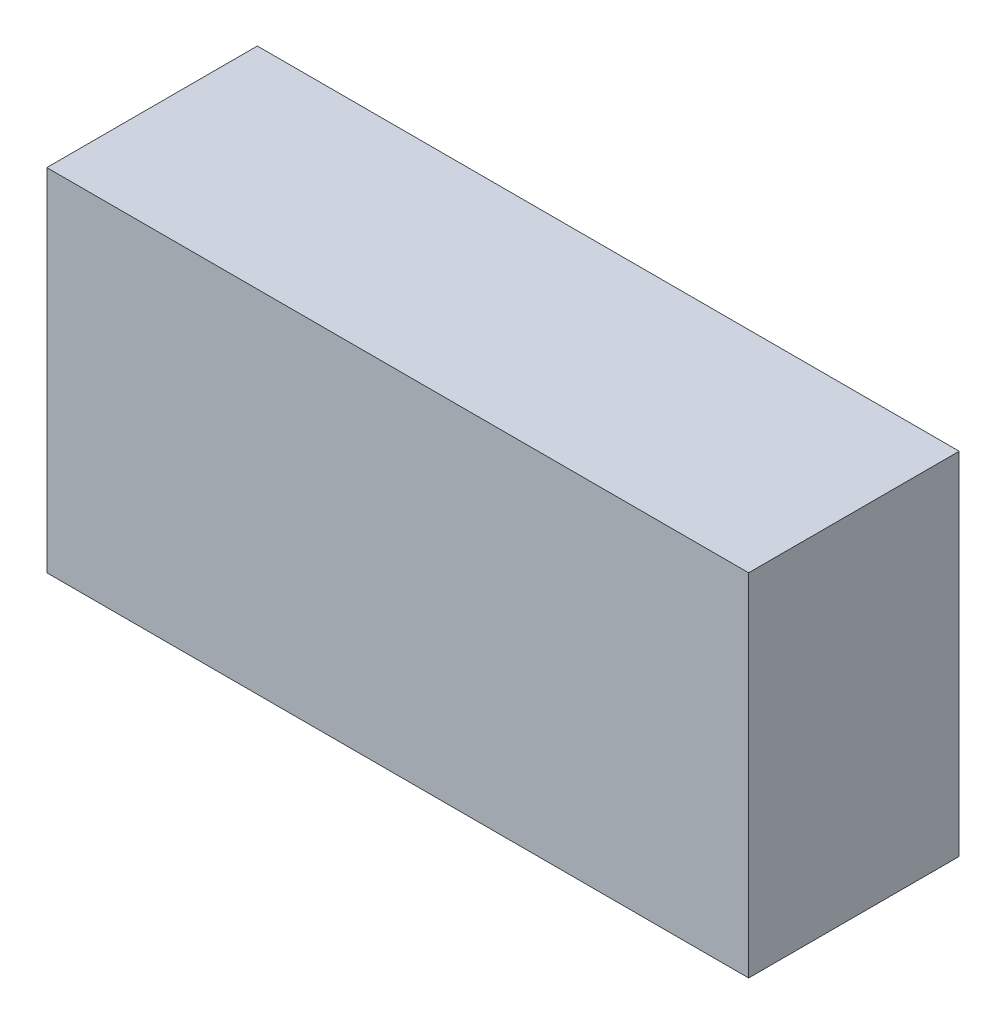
ISO-10303-21;
HEADER;
FILE_DESCRIPTION(('STEP AP214'),'2;1');
FILE_NAME('part.step','',(''),(''),'','','');
FILE_SCHEMA(('AUTOMOTIVE_DESIGN { 1 0 10303 214 1 1 1 1 }'));
ENDSEC;
DATA;
#1=APPLICATION_CONTEXT('core data for automotive mechanical design processes');
#2=APPLICATION_PROTOCOL_DEFINITION('international standard','automotive_design',2000,#1);
#3=PRODUCT_CONTEXT('',#1,'mechanical');
#4=PRODUCT('Part','Part','',(#3));
#5=PRODUCT_RELATED_PRODUCT_CATEGORY('part','',(#4));
#6=PRODUCT_DEFINITION_FORMATION('','',#4);
#7=PRODUCT_DEFINITION_CONTEXT('part definition',#1,'design');
#8=PRODUCT_DEFINITION('design','',#6,#7);
#9=PRODUCT_DEFINITION_SHAPE('','',#8);
#10=(LENGTH_UNIT() NAMED_UNIT(*) SI_UNIT(.MILLI.,.METRE.));
#11=(NAMED_UNIT(*) PLANE_ANGLE_UNIT() SI_UNIT($,.RADIAN.));
#12=(NAMED_UNIT(*) SI_UNIT($,.STERADIAN.) SOLID_ANGLE_UNIT());
#13=UNCERTAINTY_MEASURE_WITH_UNIT(LENGTH_MEASURE(1.E-05),#10,'distance_accuracy_value','');
#14=(GEOMETRIC_REPRESENTATION_CONTEXT(3) GLOBAL_UNCERTAINTY_ASSIGNED_CONTEXT((#13)) GLOBAL_UNIT_ASSIGNED_CONTEXT((#10,
#11,#12)) REPRESENTATION_CONTEXT('',''));
#15=CARTESIAN_POINT('',(0.,0.,0.));
#16=DIRECTION('',(0.,0.,1.));
#17=DIRECTION('',(1.,0.,0.));
#18=AXIS2_PLACEMENT_3D('',#15,#16,#17);
#19=CARTESIAN_POINT('',(0.,0.,30.));
#20=DIRECTION('',(1.,0.,0.));
#21=DIRECTION('',(0.,0.,-1.));
#22=AXIS2_PLACEMENT_3D('',#19,#20,#21);
#23=PLANE('',#22);
#24=DIRECTION('',(0.,-1.,0.));
#25=VECTOR('',#24,1.);
#26=CARTESIAN_POINT('',(0.,0.,0.));
#27=LINE('',#26,#25);
#28=CARTESIAN_POINT('',(0.,50.,0.));
#29=VERTEX_POINT('',#28);
#30=CARTESIAN_POINT('',(0.,0.,0.));
#31=VERTEX_POINT('',#30);
#32=EDGE_CURVE('E95',#29,#31,#27,.T.);
#33=ORIENTED_EDGE('',*,*,#32,.T.);
#34=DIRECTION('',(0.,0.,-1.));
#35=VECTOR('',#34,1.);
#36=CARTESIAN_POINT('',(0.,0.,30.));
#37=LINE('',#36,#35);
#38=CARTESIAN_POINT('',(0.,0.,30.));
#39=VERTEX_POINT('',#38);
#40=EDGE_CURVE('E11',#39,#31,#37,.T.);
#41=ORIENTED_EDGE('',*,*,#40,.F.);
#42=DIRECTION('',(0.,-1.,0.));
#43=VECTOR('',#42,1.);
#44=CARTESIAN_POINT('',(0.,0.,30.));
#45=LINE('',#44,#43);
#46=CARTESIAN_POINT('',(0.,50.,30.));
#47=VERTEX_POINT('',#46);
#48=EDGE_CURVE('E83',#47,#39,#45,.T.);
#49=ORIENTED_EDGE('',*,*,#48,.F.);
#50=DIRECTION('',(0.,0.,-1.));
#51=VECTOR('',#50,1.);
#52=CARTESIAN_POINT('',(0.,50.,30.));
#53=LINE('',#52,#51);
#54=EDGE_CURVE('E91',#47,#29,#53,.T.);
#55=ORIENTED_EDGE('',*,*,#54,.T.);
#56=EDGE_LOOP('',(#33,#41,#49,#55));
#57=FACE_BOUND('',#56,.T.);
#58=ADVANCED_FACE('F32',(#57),#23,.F.);
#59=CARTESIAN_POINT('',(0.,0.,30.));
#60=DIRECTION('',(0.,1.,0.));
#61=DIRECTION('',(0.,0.,1.));
#62=AXIS2_PLACEMENT_3D('',#59,#60,#61);
#63=PLANE('',#62);
#64=DIRECTION('',(1.,0.,0.));
#65=VECTOR('',#64,1.);
#66=CARTESIAN_POINT('',(0.,0.,0.));
#67=LINE('',#66,#65);
#68=CARTESIAN_POINT('',(100.,0.,0.));
#69=VERTEX_POINT('',#68);
#70=EDGE_CURVE('E87',#31,#69,#67,.T.);
#71=ORIENTED_EDGE('',*,*,#70,.T.);
#72=DIRECTION('',(0.,0.,-1.));
#73=VECTOR('',#72,1.);
#74=CARTESIAN_POINT('',(100.,0.,30.));
#75=LINE('',#74,#73);
#76=CARTESIAN_POINT('',(100.,0.,30.));
#77=VERTEX_POINT('',#76);
#78=EDGE_CURVE('E40',#77,#69,#75,.T.);
#79=ORIENTED_EDGE('',*,*,#78,.F.);
#80=DIRECTION('',(1.,0.,0.));
#81=VECTOR('',#80,1.);
#82=CARTESIAN_POINT('',(0.,0.,30.));
#83=LINE('',#82,#81);
#84=EDGE_CURVE('E78',#39,#77,#83,.T.);
#85=ORIENTED_EDGE('',*,*,#84,.F.);
#86=ORIENTED_EDGE('',*,*,#40,.T.);
#87=EDGE_LOOP('',(#71,#79,#85,#86));
#88=FACE_BOUND('',#87,.T.);
#89=ADVANCED_FACE('F86',(#88),#63,.F.);
#90=CARTESIAN_POINT('',(100.,0.,30.));
#91=DIRECTION('',(-1.,0.,0.));
#92=DIRECTION('',(0.,0.,1.));
#93=AXIS2_PLACEMENT_3D('',#90,#91,#92);
#94=PLANE('',#93);
#95=DIRECTION('',(0.,1.,0.));
#96=VECTOR('',#95,1.);
#97=CARTESIAN_POINT('',(100.,0.,0.));
#98=LINE('',#97,#96);
#99=CARTESIAN_POINT('',(100.,50.,0.));
#100=VERTEX_POINT('',#99);
#101=EDGE_CURVE('E65',#69,#100,#98,.T.);
#102=ORIENTED_EDGE('',*,*,#101,.T.);
#103=DIRECTION('',(0.,0.,-1.));
#104=VECTOR('',#103,1.);
#105=CARTESIAN_POINT('',(100.,50.,30.));
#106=LINE('',#105,#104);
#107=CARTESIAN_POINT('',(100.,50.,30.));
#108=VERTEX_POINT('',#107);
#109=EDGE_CURVE('E88',#108,#100,#106,.T.);
#110=ORIENTED_EDGE('',*,*,#109,.F.);
#111=DIRECTION('',(0.,1.,0.));
#112=VECTOR('',#111,1.);
#113=CARTESIAN_POINT('',(100.,0.,30.));
#114=LINE('',#113,#112);
#115=EDGE_CURVE('E81',#77,#108,#114,.T.);
#116=ORIENTED_EDGE('',*,*,#115,.F.);
#117=ORIENTED_EDGE('',*,*,#78,.T.);
#118=EDGE_LOOP('',(#102,#110,#116,#117));
#119=FACE_BOUND('',#118,.T.);
#120=ADVANCED_FACE('F89',(#119),#94,.F.);
#121=CARTESIAN_POINT('',(0.,50.,30.));
#122=DIRECTION('',(0.,-1.,0.));
#123=DIRECTION('',(0.,0.,-1.));
#124=AXIS2_PLACEMENT_3D('',#121,#122,#123);
#125=PLANE('',#124);
#126=DIRECTION('',(-1.,0.,0.));
#127=VECTOR('',#126,1.);
#128=CARTESIAN_POINT('',(0.,50.,0.));
#129=LINE('',#128,#127);
#130=EDGE_CURVE('E71',#100,#29,#129,.T.);
#131=ORIENTED_EDGE('',*,*,#130,.T.);
#132=ORIENTED_EDGE('',*,*,#54,.F.);
#133=DIRECTION('',(-1.,0.,0.));
#134=VECTOR('',#133,1.);
#135=CARTESIAN_POINT('',(0.,50.,30.));
#136=LINE('',#135,#134);
#137=EDGE_CURVE('E48',#108,#47,#136,.T.);
#138=ORIENTED_EDGE('',*,*,#137,.F.);
#139=ORIENTED_EDGE('',*,*,#109,.T.);
#140=EDGE_LOOP('',(#131,#132,#138,#139));
#141=FACE_BOUND('',#140,.T.);
#142=ADVANCED_FACE('F102',(#141),#125,.F.);
#143=CARTESIAN_POINT('',(0.,50.,30.));
#144=DIRECTION('',(0.,0.,-1.));
#145=DIRECTION('',(-1.,0.,0.));
#146=AXIS2_PLACEMENT_3D('',#143,#144,#145);
#147=PLANE('',#146);
#148=ORIENTED_EDGE('',*,*,#48,.T.);
#149=ORIENTED_EDGE('',*,*,#84,.T.);
#150=ORIENTED_EDGE('',*,*,#115,.T.);
#151=ORIENTED_EDGE('',*,*,#137,.T.);
#152=EDGE_LOOP('',(#148,#149,#150,#151));
#153=FACE_BOUND('',#152,.T.);
#154=ADVANCED_FACE('F79',(#153),#147,.F.);
#155=CARTESIAN_POINT('',(0.,50.,0.));
#156=DIRECTION('',(0.,0.,-1.));
#157=DIRECTION('',(-1.,0.,0.));
#158=AXIS2_PLACEMENT_3D('',#155,#156,#157);
#159=PLANE('',#158);
#160=ORIENTED_EDGE('',*,*,#32,.F.);
#161=ORIENTED_EDGE('',*,*,#130,.F.);
#162=ORIENTED_EDGE('',*,*,#101,.F.);
#163=ORIENTED_EDGE('',*,*,#70,.F.);
#164=EDGE_LOOP('',(#160,#161,#162,#163));
#165=FACE_BOUND('',#164,.T.);
#166=ADVANCED_FACE('F105',(#165),#159,.T.);
#167=CLOSED_SHELL('',(#58,#89,#120,#142,#154,#166));
#168=MANIFOLD_SOLID_BREP('B2',#167);
#169=ADVANCED_BREP_SHAPE_REPRESENTATION('',(#18,#168),#14);
#170=SHAPE_DEFINITION_REPRESENTATION(#9,#169);
ENDSEC;
END-ISO-10303-21;
